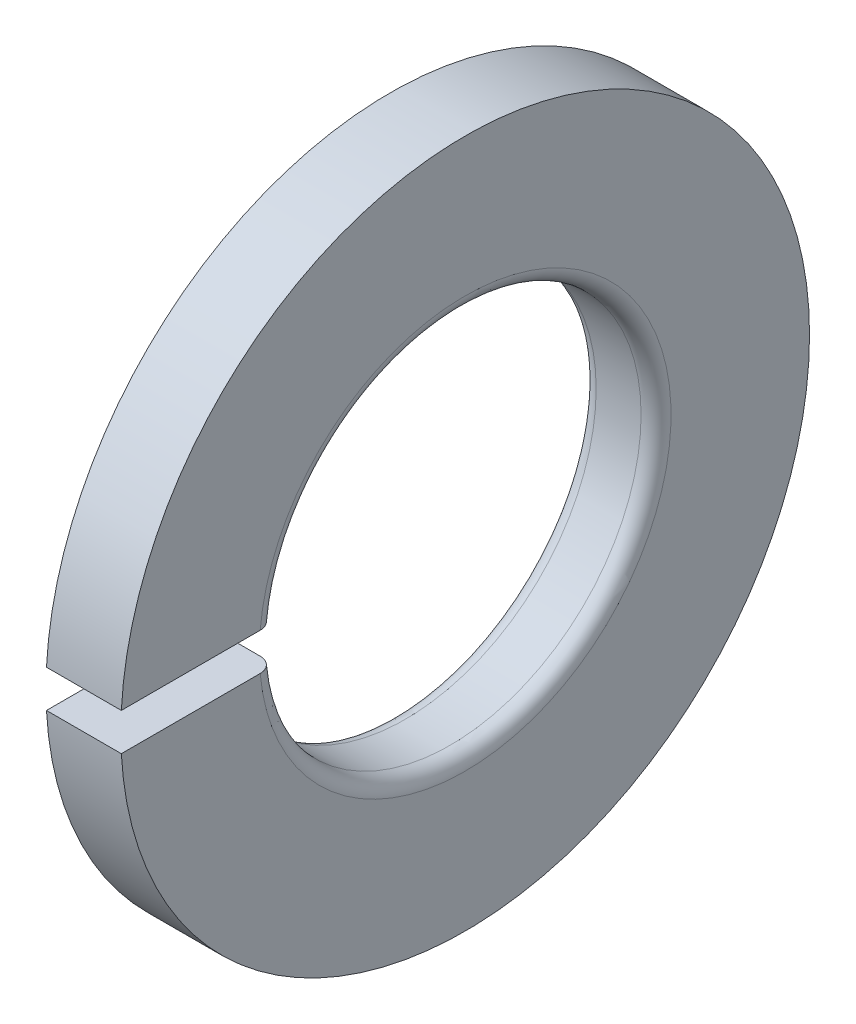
from build123d import *

# Parameters (mm, degrees)
SKETCH2_W = 0.5
SKETCH2_H = 4.692
GAP_DEPTH = 7.581793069


with BuildPart() as part:
    # Sketch1 → Base-Revolve (revolve)
    with BuildSketch(Plane.XY, mode=Mode.PRIVATE) as base_revolve_sk:
        with BuildLine():
            Line((0, 2.75), (0, 4.6))
            Line((0, 4.6), (-1, 4.6))
            Line((-1, 4.6), (-1, 2.75))
            ThreePointArc((-1, 2.75), (-0.941421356, 2.608578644), (-0.8, 2.55))
            Line((-0.8, 2.55), (-0.2, 2.55))
            ThreePointArc((-0.2, 2.55), (-0.058578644, 2.608578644), (0, 2.75))
        make_face()
    revolve(base_revolve_sk.sketch.rotate(Axis((-34.925, 0, 0), (1, 0, 0)), 90), axis=Axis((-34.925, 0, 0), (1, 0, 0)))

    # Sketch2 → Gap (cut, through all)
    with BuildSketch(Plane(origin=(0, 0, 0), x_dir=(0, -1, 0), z_dir=(-1, 0, 0))):
        with Locations((0, 2.346)):
            Rectangle(SKETCH2_W, SKETCH2_H)
    extrude(amount=GAP_DEPTH, mode=Mode.SUBTRACT)


solid = part.part
